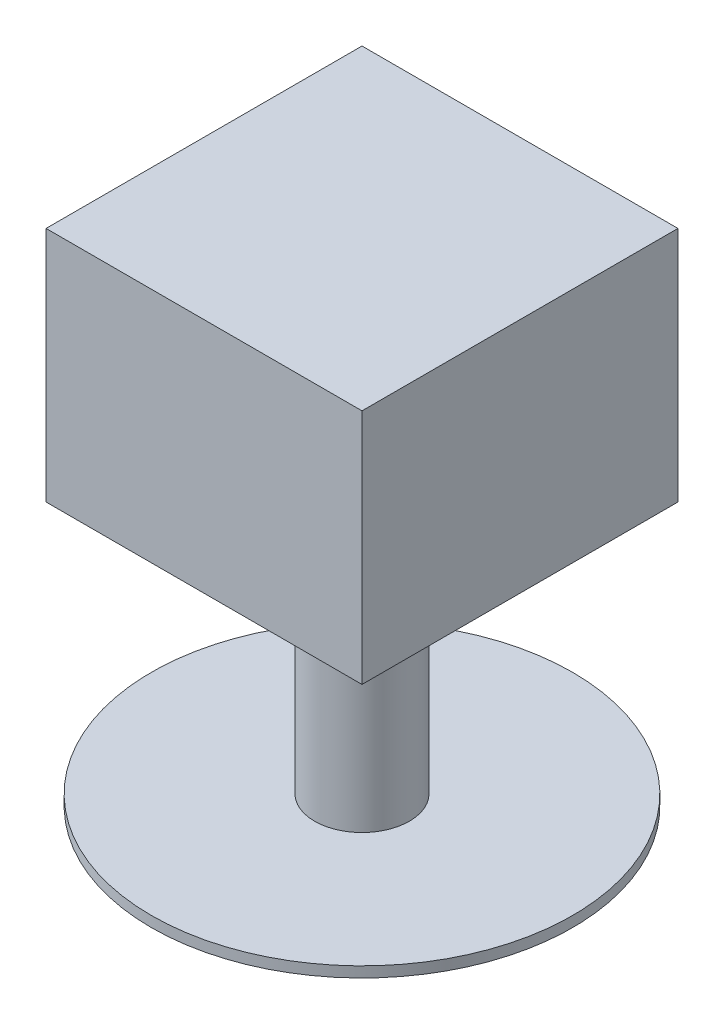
from build123d import *

# Parameters (mm, degrees)
ESQUISSE2_R        = 40
BOSS_EXTRU_2_DEPTH = 2
ESQUISSE4_W        = 60
ESQUISSE4_H        = 60
BOSS_EXTRU_3_DEPTH = 45
ESQUISSE3_R        = 9
BOSS_EXTRU_4_DEPTH = 48


with BuildPart() as part:
    # Esquisse2 → Boss.-Extru.2 (new body)
    with BuildSketch(Plane(origin=(0, -70, 0), x_dir=(-1, 0, 0), z_dir=(0, 1, 0))):
        with Locations(Location((0, 0, 0), (0, 0, 90))):
            Circle(ESQUISSE2_R)
    extrude(amount=BOSS_EXTRU_2_DEPTH)



with BuildPart() as body_2:
    # Esquisse4 → Boss.-Extru.3 (new body)
    with BuildSketch(Plane(origin=(0, -20, 0), x_dir=(-1, 0, 0), z_dir=(0, 1, 0))):
        Rectangle(ESQUISSE4_W, ESQUISSE4_H)
    extrude(amount=BOSS_EXTRU_3_DEPTH)


with BuildPart() as part_1:
    add(part.part)

    add(body_2.part)  # Boss.-Extru.4 merges body 2
    # Esquisse3 → Boss.-Extru.4 (add)
    with BuildSketch(Plane(origin=(0, -68, 0), x_dir=(1, 0, 0), z_dir=(0, 1, 0))):
        with Locations(Location((0, 0, 0), (0, 0, 270))):
            Circle(ESQUISSE3_R)
    extrude(amount=BOSS_EXTRU_4_DEPTH)


solid = part_1.part
